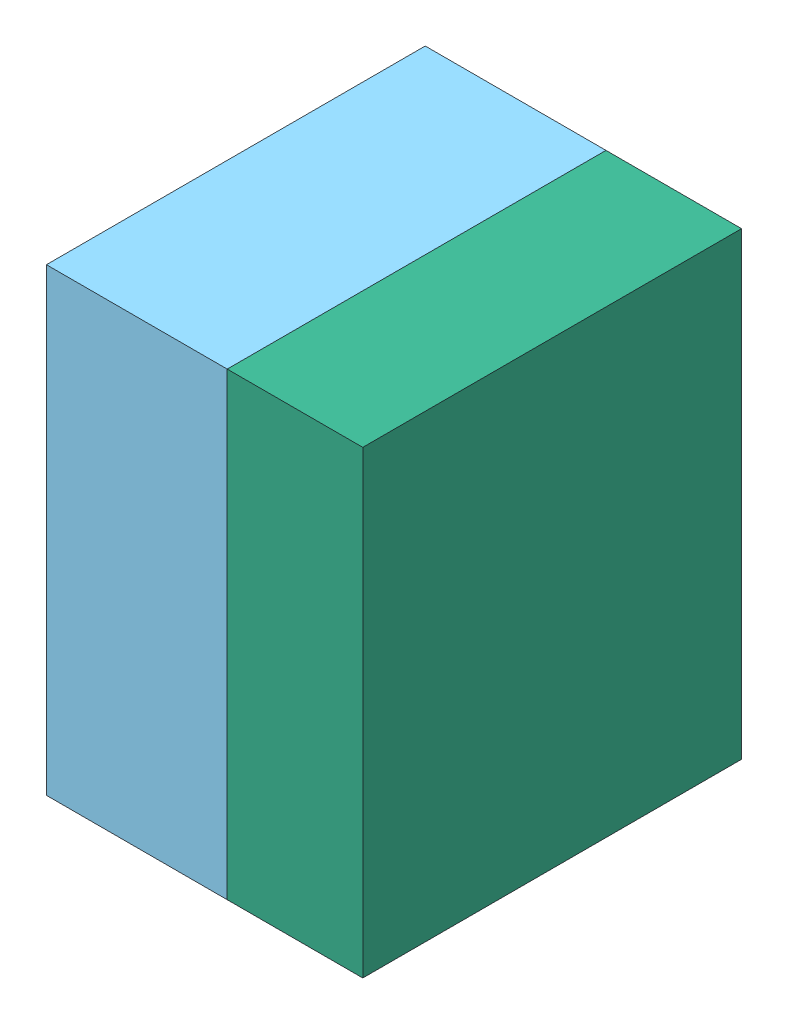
SolidWorks assembly outillage.SLDASM, configuration Défaut (file format 3100). Lengths in mm.
Overall size (210 305.08 251.46).
6 component instances, 6 part files, 20 mates.
Components (placement in the parent):
- PièceBrute+Dep+Ret-1: PièceBrute+Dep+Ret.SLDPRT [Défaut] at origin size (141.41 175.24 77.67)
- modele-1: modele.SLDPRT [Défaut] at (-0.2044 0 30) size (164.73 210.58 144.27)
- noyau inter-1: noyau inter.SLDPRT [Défaut] at (-0.2044 0 5.8542) x (0.999391 0 0.034899) z (-0.034899 0 0.999391) size (149.04 115.49 131.93)
- noyau exter-1: noyau exter.SLDPRT [Défaut] at (-52.5092 0 0) x (0 0 1) z (-1 0 0) size (109.19 70.63 51.42)
- DemiNégatifDO-1: DemiNégatifDO.SLDPRT [Défaut] x (0 0 -1) z (1 0 0) size (251.46 305.08 120.23)
- DemiNégatifDU-1: DemiNégatifDU.SLDPRT [Défaut] x (0 0 -1) z (1 0 0) size (251.46 305.08 90.83)
Mates (geometry in assembly coordinates):
- Sur place1: in place: plane of PièceBrute+Dep+Ret-1 through (-70.6911 45.5485 3.3928) normal (-0.034899 0 0.999391); plane of noyau inter-1; moOrthogonalPlaneRef_w of PièceBrute+Dep+Ret-1; plane of noyau inter-1; moOrthogonalPlaneRef_w of PièceBrute+Dep+Ret-1; plane of noyau inter-1
- Coïncidente1: coincident aligned: plane of PièceBrute+Dep+Ret-1; plane of noyau inter-1
- Coïncidente2: coincident aligned: moOrthogonalPlaneRef_w of PièceBrute+Dep+Ret-1; plane of noyau inter-1
- Coïncidente3: coincident anti-aligned: moOrthogonalPlaneRef_w of PièceBrute+Dep+Ret-1; plane of noyau inter-1
- Sur place2: in place: plane of noyau inter-1 through (0.016 0.599 30) normal (0 0 1); plane of modele-1; moOrthogonalPlaneRef_w of noyau inter-1; plane of modele-1; moOrthogonalPlaneRef_w of noyau inter-1; plane of modele-1
- Coïncidente1: coincident aligned: plane of noyau inter-1; plane of modele-1
- Coïncidente2: coincident aligned: moOrthogonalPlaneRef_w of noyau inter-1; plane of modele-1
- Coïncidente3: coincident anti-aligned: moOrthogonalPlaneRef_w of noyau inter-1; plane of modele-1
- Sur place5: in place: plane of PièceBrute+Dep+Ret-1 through (-52.5092 -51.9262 -32.9708) normal (-1 0 0); plane of noyau exter-1; moOrthogonalPlaneRef_w of PièceBrute+Dep+Ret-1; plane of noyau exter-1; moOrthogonalPlaneRef_w of PièceBrute+Dep+Ret-1; plane of noyau exter-1
- Coïncidente10: coincident aligned: plane of PièceBrute+Dep+Ret-1; plane of noyau exter-1
- Coïncidente11: coincident aligned: moOrthogonalPlaneRef_w of PièceBrute+Dep+Ret-1; plane of noyau exter-1
- Coïncidente12: coincident anti-aligned: moOrthogonalPlaneRef_w of PièceBrute+Dep+Ret-1; plane of noyau exter-1
- Sur place8: in place: unknown of ?
- Coïncidente1: coincident aligned: plane of DemiNégatifDO-1; plane of assembly
- Coïncidente2: coincident aligned: plane of DemiNégatifDO-1; moOrthogonalPlaneRef_w of assembly
- Coïncidente3: coincident anti-aligned: plane of DemiNégatifDO-1; moOrthogonalPlaneRef_w of assembly
- Sur place9: in place: unknown of ?
- Coïncidente4: coincident aligned: plane of DemiNégatifDU-1; plane of assembly
- Coïncidente5: coincident aligned: plane of DemiNégatifDU-1; moOrthogonalPlaneRef_w of assembly
- Coïncidente6: coincident anti-aligned: 
